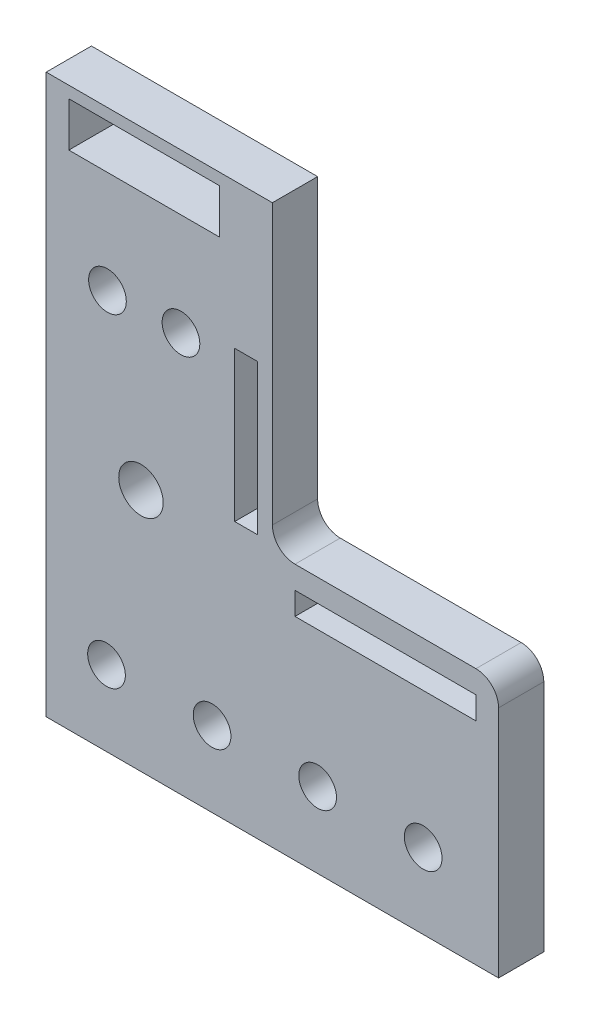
from build123d import *

# Parameters (mm, degrees)
SKETCH1_R           = 2.5
SKETCH1_W           = 20
SKETCH1_H           = 5.9
SKETCH1_W_2         = 3
SKETCH1_H_2         = 19.898661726
SKETCH1_W_3         = 24
SKETCH1_H_3         = 3
BOSS_EXTRUDE1_DEPTH = 6
SKETCH2_R           = 2.95
CUT_EXTRUDE1_DEPTH  = 1.5
SKETCH3_R           = 2.95
CUT_EXTRUDE2_DEPTH  = 10


with BuildPart() as part:
    # Sketch1 → Boss-Extrude1 (new body)
    with BuildSketch(Plane.XY):
        with BuildLine():
            Line((-328.028662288, 66.751458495), (-328.028662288, -7.301419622))
            Line((-328.028662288, -7.301419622), (-268.028662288, -7.301419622))
            Line((-268.028662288, -7.301419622), (-268.028662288, 23.730506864))
            ThreePointArc((-268.028662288, 23.730506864), (-268.907341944, 25.851827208), (-271.028662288, 26.730506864))
            Line((-271.028662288, 26.730506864), (-295.028662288, 26.730506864))
            ThreePointArc((-295.028662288, 26.730506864), (-297.149982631, 27.60918652), (-298.028662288, 29.730506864))
            Line((-298.028662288, 29.730506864), (-298.028662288, 66.751458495))
            Line((-298.028662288, 66.751458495), (-328.028662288, 66.751458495))
        make_face()
        with Locations((-320.028662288, 2.698580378)):
            Circle(SKETCH1_R, mode=Mode.SUBTRACT)
        with Locations((-306.028662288, 2.698580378)):
            Circle(SKETCH1_R, mode=Mode.SUBTRACT)
        with Locations((-292.028662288, 2.698580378)):
            Circle(SKETCH1_R, mode=Mode.SUBTRACT)
        with Locations((-278.028662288, 2.698580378)):
            Circle(SKETCH1_R, mode=Mode.SUBTRACT)
        with Locations((-319.903662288, 45.726954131)):
            Circle(SKETCH1_R, mode=Mode.SUBTRACT)
        with Locations((-310.153662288, 45.726954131)):
            Circle(SKETCH1_R, mode=Mode.SUBTRACT)
        with Locations((-315.028662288, 62.245809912)):
            Rectangle(SKETCH1_W, SKETCH1_H, mode=Mode.SUBTRACT)
        with Locations((-301.528662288, 37.580135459)):
            Rectangle(SKETCH1_W_2, SKETCH1_H_2, mode=Mode.SUBTRACT)
        with Locations((-283.028662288, 22.230506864)):
            Rectangle(SKETCH1_W_3, SKETCH1_H_3, mode=Mode.SUBTRACT)
    extrude(amount=BOSS_EXTRUDE1_DEPTH)

    # Sketch2 → Cut-Extrude1 (cut)
    with BuildSketch(Plane(origin=(0, 0, 0), x_dir=(-1, 0, 0), z_dir=(0, 0, -1))):
        with Locations((315.457743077, 25.038103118)):
            Circle(SKETCH2_R)
    extrude(amount=-CUT_EXTRUDE1_DEPTH, mode=Mode.SUBTRACT)

    # Sketch3 → Cut-Extrude2 (cut)
    with BuildSketch(Plane(origin=(0, 0, 0), x_dir=(-1, 0, 0), z_dir=(0, 0, -1))):
        with Locations((315.457743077, 25.038103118)):
            Circle(SKETCH3_R)
    extrude(amount=-CUT_EXTRUDE2_DEPTH, mode=Mode.SUBTRACT)


solid = part.part
